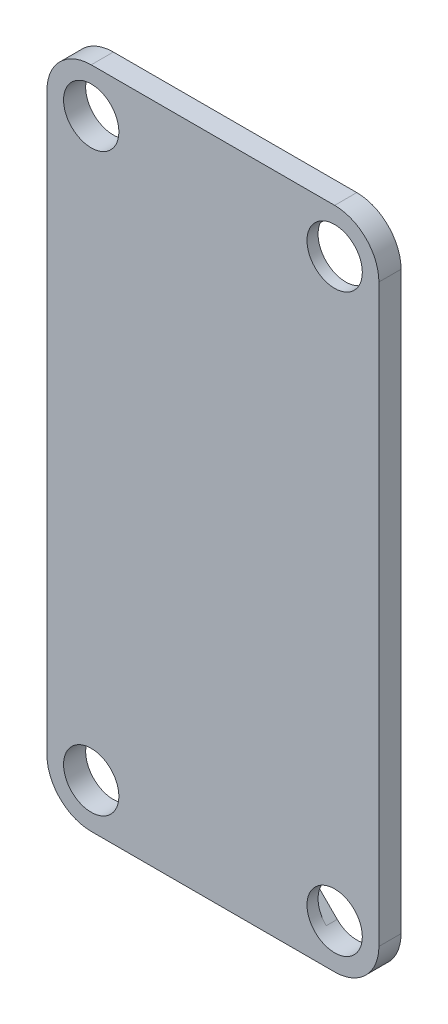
ISO-10303-21;
HEADER;
FILE_DESCRIPTION(('STEP AP214'),'2;1');
FILE_NAME('part.step','',(''),(''),'','','');
FILE_SCHEMA(('AUTOMOTIVE_DESIGN { 1 0 10303 214 1 1 1 1 }'));
ENDSEC;
DATA;
#1=APPLICATION_CONTEXT('core data for automotive mechanical design processes');
#2=APPLICATION_PROTOCOL_DEFINITION('international standard','automotive_design',2000,#1);
#3=PRODUCT_CONTEXT('',#1,'mechanical');
#4=PRODUCT('Part','Part','',(#3));
#5=PRODUCT_RELATED_PRODUCT_CATEGORY('part','',(#4));
#6=PRODUCT_DEFINITION_FORMATION('','',#4);
#7=PRODUCT_DEFINITION_CONTEXT('part definition',#1,'design');
#8=PRODUCT_DEFINITION('design','',#6,#7);
#9=PRODUCT_DEFINITION_SHAPE('','',#8);
#10=(LENGTH_UNIT() NAMED_UNIT(*) SI_UNIT(.MILLI.,.METRE.));
#11=(NAMED_UNIT(*) PLANE_ANGLE_UNIT() SI_UNIT($,.RADIAN.));
#12=(NAMED_UNIT(*) SI_UNIT($,.STERADIAN.) SOLID_ANGLE_UNIT());
#13=UNCERTAINTY_MEASURE_WITH_UNIT(LENGTH_MEASURE(1.E-05),#10,'distance_accuracy_value','');
#14=(GEOMETRIC_REPRESENTATION_CONTEXT(3) GLOBAL_UNCERTAINTY_ASSIGNED_CONTEXT((#13)) GLOBAL_UNIT_ASSIGNED_CONTEXT((#10,
#11,#12)) REPRESENTATION_CONTEXT('',''));
#15=CARTESIAN_POINT('',(0.,0.,0.));
#16=DIRECTION('',(0.,0.,1.));
#17=DIRECTION('',(1.,0.,0.));
#18=AXIS2_PLACEMENT_3D('',#15,#16,#17);
#19=CARTESIAN_POINT('',(-220.,-520.,0.));
#20=DIRECTION('',(0.,0.,1.));
#21=DIRECTION('',(1.,0.,0.));
#22=AXIS2_PLACEMENT_3D('',#19,#20,#21);
#23=PLANE('',#22);
#24=CARTESIAN_POINT('',(-220.,520.,0.));
#25=DIRECTION('',(0.,0.,1.));
#26=DIRECTION('',(1.,0.,0.));
#27=AXIS2_PLACEMENT_3D('',#24,#25,#26);
#28=CIRCLE('',#27,50.);
#29=CARTESIAN_POINT('',(-170.,520.,0.));
#30=VERTEX_POINT('',#29);
#31=EDGE_CURVE('E254',#30,#30,#28,.T.);
#32=ORIENTED_EDGE('',*,*,#31,.T.);
#33=EDGE_LOOP('',(#32));
#34=FACE_BOUND('',#33,.T.);
#35=CARTESIAN_POINT('',(-219.999999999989,-520.,0.));
#36=DIRECTION('',(0.,0.,1.));
#37=DIRECTION('',(1.,0.,0.));
#38=AXIS2_PLACEMENT_3D('',#35,#36,#37);
#39=CIRCLE('',#38,50.);
#40=CARTESIAN_POINT('',(-169.999999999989,-520.,0.));
#41=VERTEX_POINT('',#40);
#42=EDGE_CURVE('E230',#41,#41,#39,.T.);
#43=ORIENTED_EDGE('',*,*,#42,.T.);
#44=EDGE_LOOP('',(#43));
#45=FACE_BOUND('',#44,.T.);
#46=CARTESIAN_POINT('',(-220.,-520.,0.));
#47=DIRECTION('',(0.,0.,1.));
#48=DIRECTION('',(1.,0.,0.));
#49=AXIS2_PLACEMENT_3D('',#46,#47,#48);
#50=CIRCLE('',#49,80.);
#51=CARTESIAN_POINT('',(-300.,-520.,0.));
#52=VERTEX_POINT('',#51);
#53=CARTESIAN_POINT('',(-219.999999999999,-600.,0.));
#54=VERTEX_POINT('',#53);
#55=EDGE_CURVE('E160',#52,#54,#50,.T.);
#56=ORIENTED_EDGE('',*,*,#55,.F.);
#57=DIRECTION('',(0.,-1.,0.));
#58=VECTOR('',#57,1.);
#59=CARTESIAN_POINT('',(-300.,519.999999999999,0.));
#60=LINE('',#59,#58);
#61=CARTESIAN_POINT('',(-300.,519.999999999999,0.));
#62=VERTEX_POINT('',#61);
#63=EDGE_CURVE('E102',#62,#52,#60,.T.);
#64=ORIENTED_EDGE('',*,*,#63,.F.);
#65=CARTESIAN_POINT('',(-220.,520.,0.));
#66=DIRECTION('',(0.,0.,1.));
#67=DIRECTION('',(1.,0.,0.));
#68=AXIS2_PLACEMENT_3D('',#65,#66,#67);
#69=CIRCLE('',#68,80.);
#70=CARTESIAN_POINT('',(-219.999999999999,600.,0.));
#71=VERTEX_POINT('',#70);
#72=EDGE_CURVE('E179',#71,#62,#69,.T.);
#73=ORIENTED_EDGE('',*,*,#72,.F.);
#74=DIRECTION('',(-1.,0.,0.));
#75=VECTOR('',#74,1.);
#76=CARTESIAN_POINT('',(219.999999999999,600.,0.));
#77=LINE('',#76,#75);
#78=CARTESIAN_POINT('',(219.999999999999,600.,0.));
#79=VERTEX_POINT('',#78);
#80=EDGE_CURVE('E144',#79,#71,#77,.T.);
#81=ORIENTED_EDGE('',*,*,#80,.F.);
#82=CARTESIAN_POINT('',(220.,520.,0.));
#83=DIRECTION('',(0.,0.,1.));
#84=DIRECTION('',(1.,0.,0.));
#85=AXIS2_PLACEMENT_3D('',#82,#83,#84);
#86=CIRCLE('',#85,80.);
#87=CARTESIAN_POINT('',(300.,519.999999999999,0.));
#88=VERTEX_POINT('',#87);
#89=EDGE_CURVE('E174',#88,#79,#86,.T.);
#90=ORIENTED_EDGE('',*,*,#89,.F.);
#91=DIRECTION('',(0.,1.,0.));
#92=VECTOR('',#91,1.);
#93=CARTESIAN_POINT('',(300.,-520.,0.));
#94=LINE('',#93,#92);
#95=CARTESIAN_POINT('',(300.,-520.,0.));
#96=VERTEX_POINT('',#95);
#97=EDGE_CURVE('E171',#96,#88,#94,.T.);
#98=ORIENTED_EDGE('',*,*,#97,.F.);
#99=CARTESIAN_POINT('',(220.,-520.,0.));
#100=DIRECTION('',(0.,0.,1.));
#101=DIRECTION('',(1.,0.,0.));
#102=AXIS2_PLACEMENT_3D('',#99,#100,#101);
#103=CIRCLE('',#102,80.);
#104=CARTESIAN_POINT('',(219.999999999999,-600.,0.));
#105=VERTEX_POINT('',#104);
#106=EDGE_CURVE('E168',#105,#96,#103,.T.);
#107=ORIENTED_EDGE('',*,*,#106,.F.);
#108=DIRECTION('',(1.,0.,0.));
#109=VECTOR('',#108,1.);
#110=CARTESIAN_POINT('',(-219.999999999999,-600.,0.));
#111=LINE('',#110,#109);
#112=EDGE_CURVE('E164',#54,#105,#111,.T.);
#113=ORIENTED_EDGE('',*,*,#112,.F.);
#114=EDGE_LOOP('',(#56,#64,#73,#81,#90,#98,#107,#113));
#115=FACE_BOUND('',#114,.T.);
#116=DIRECTION('',(0.,1.,0.));
#117=VECTOR('',#116,1.);
#118=CARTESIAN_POINT('',(270.000000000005,2.82466357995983E-12,0.));
#119=LINE('',#118,#117);
#120=CARTESIAN_POINT('',(270.000000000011,-520.,0.));
#121=VERTEX_POINT('',#120);
#122=CARTESIAN_POINT('',(270.,520.,0.));
#123=VERTEX_POINT('',#122);
#124=EDGE_CURVE('E286',#121,#123,#119,.T.);
#125=ORIENTED_EDGE('',*,*,#124,.T.);
#126=CARTESIAN_POINT('',(220.,520.,0.));
#127=DIRECTION('',(0.,0.,1.));
#128=DIRECTION('',(1.,0.,0.));
#129=AXIS2_PLACEMENT_3D('',#126,#127,#128);
#130=CIRCLE('',#129,50.0000000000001);
#131=CARTESIAN_POINT('',(174.091058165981,539.80830784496,0.));
#132=VERTEX_POINT('',#131);
#133=EDGE_CURVE('E246',#123,#132,#130,.T.);
#134=ORIENTED_EDGE('',*,*,#133,.T.);
#135=DIRECTION('',(0.707106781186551,0.707106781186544,0.));
#136=VECTOR('',#135,1.);
#137=CARTESIAN_POINT('',(-182.85862483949,182.858624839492,0.));
#138=LINE('',#137,#136);
#139=CARTESIAN_POINT('',(-230.,135.717249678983,0.));
#140=VERTEX_POINT('',#139);
#141=EDGE_CURVE('E291',#140,#132,#138,.T.);
#142=ORIENTED_EDGE('',*,*,#141,.F.);
#143=DIRECTION('',(0.,1.,0.));
#144=VECTOR('',#143,1.);
#145=CARTESIAN_POINT('',(-230.,0.,0.));
#146=LINE('',#145,#144);
#147=CARTESIAN_POINT('',(-230.,-140.710678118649,0.));
#148=VERTEX_POINT('',#147);
#149=EDGE_CURVE('E295',#148,#140,#146,.T.);
#150=ORIENTED_EDGE('',*,*,#149,.F.);
#151=DIRECTION('',(-0.707106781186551,0.707106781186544,0.));
#152=VECTOR('',#151,1.);
#153=CARTESIAN_POINT('',(-185.355339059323,-185.355339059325,0.));
#154=LINE('',#153,#152);
#155=CARTESIAN_POINT('',(184.644660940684,-555.355339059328,0.));
#156=VERTEX_POINT('',#155);
#157=EDGE_CURVE('E299',#156,#148,#154,.T.);
#158=ORIENTED_EDGE('',*,*,#157,.F.);
#159=CARTESIAN_POINT('',(220.000000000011,-520.,0.));
#160=DIRECTION('',(0.,0.,1.));
#161=DIRECTION('',(1.,0.,0.));
#162=AXIS2_PLACEMENT_3D('',#159,#160,#161);
#163=CIRCLE('',#162,50.0000000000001);
#164=EDGE_CURVE('E238',#156,#121,#163,.T.);
#165=ORIENTED_EDGE('',*,*,#164,.T.);
#166=EDGE_LOOP('',(#125,#134,#142,#150,#158,#165));
#167=FACE_BOUND('',#166,.T.);
#168=ADVANCED_FACE('F44',(#34,#45,#115,#167),#23,.F.);
#169=CARTESIAN_POINT('',(-220.,-520.,40.));
#170=DIRECTION('',(0.,0.,1.));
#171=DIRECTION('',(1.,0.,0.));
#172=AXIS2_PLACEMENT_3D('',#169,#170,#171);
#173=PLANE('',#172);
#174=CARTESIAN_POINT('',(220.,520.,40.));
#175=DIRECTION('',(0.,0.,1.));
#176=DIRECTION('',(1.,0.,0.));
#177=AXIS2_PLACEMENT_3D('',#174,#175,#176);
#178=CIRCLE('',#177,50.0000000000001);
#179=CARTESIAN_POINT('',(270.,520.,40.));
#180=VERTEX_POINT('',#179);
#181=EDGE_CURVE('E242',#180,#180,#178,.T.);
#182=ORIENTED_EDGE('',*,*,#181,.F.);
#183=EDGE_LOOP('',(#182));
#184=FACE_BOUND('',#183,.T.);
#185=CARTESIAN_POINT('',(-219.999999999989,-520.,40.));
#186=DIRECTION('',(0.,0.,1.));
#187=DIRECTION('',(1.,0.,0.));
#188=AXIS2_PLACEMENT_3D('',#185,#186,#187);
#189=CIRCLE('',#188,50.);
#190=CARTESIAN_POINT('',(-169.999999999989,-520.,40.));
#191=VERTEX_POINT('',#190);
#192=EDGE_CURVE('E165',#191,#191,#189,.T.);
#193=ORIENTED_EDGE('',*,*,#192,.F.);
#194=EDGE_LOOP('',(#193));
#195=FACE_BOUND('',#194,.T.);
#196=CARTESIAN_POINT('',(-220.,-520.,40.));
#197=DIRECTION('',(0.,0.,1.));
#198=DIRECTION('',(1.,0.,0.));
#199=AXIS2_PLACEMENT_3D('',#196,#197,#198);
#200=CIRCLE('',#199,80.);
#201=CARTESIAN_POINT('',(-300.,-520.,40.));
#202=VERTEX_POINT('',#201);
#203=CARTESIAN_POINT('',(-219.999999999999,-600.,40.));
#204=VERTEX_POINT('',#203);
#205=EDGE_CURVE('E184',#202,#204,#200,.T.);
#206=ORIENTED_EDGE('',*,*,#205,.T.);
#207=DIRECTION('',(1.,0.,0.));
#208=VECTOR('',#207,1.);
#209=CARTESIAN_POINT('',(-219.999999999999,-600.,40.));
#210=LINE('',#209,#208);
#211=CARTESIAN_POINT('',(219.999999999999,-600.,40.));
#212=VERTEX_POINT('',#211);
#213=EDGE_CURVE('E110',#204,#212,#210,.T.);
#214=ORIENTED_EDGE('',*,*,#213,.T.);
#215=CARTESIAN_POINT('',(220.,-520.,40.));
#216=DIRECTION('',(0.,0.,1.));
#217=DIRECTION('',(1.,0.,0.));
#218=AXIS2_PLACEMENT_3D('',#215,#216,#217);
#219=CIRCLE('',#218,80.);
#220=CARTESIAN_POINT('',(300.,-520.,40.));
#221=VERTEX_POINT('',#220);
#222=EDGE_CURVE('E206',#212,#221,#219,.T.);
#223=ORIENTED_EDGE('',*,*,#222,.T.);
#224=DIRECTION('',(0.,1.,0.));
#225=VECTOR('',#224,1.);
#226=CARTESIAN_POINT('',(300.,-520.,40.));
#227=LINE('',#226,#225);
#228=CARTESIAN_POINT('',(300.,519.999999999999,40.));
#229=VERTEX_POINT('',#228);
#230=EDGE_CURVE('E219',#221,#229,#227,.T.);
#231=ORIENTED_EDGE('',*,*,#230,.T.);
#232=CARTESIAN_POINT('',(220.,520.,40.));
#233=DIRECTION('',(0.,0.,1.));
#234=DIRECTION('',(1.,0.,0.));
#235=AXIS2_PLACEMENT_3D('',#232,#233,#234);
#236=CIRCLE('',#235,80.);
#237=CARTESIAN_POINT('',(219.999999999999,600.,40.));
#238=VERTEX_POINT('',#237);
#239=EDGE_CURVE('E134',#229,#238,#236,.T.);
#240=ORIENTED_EDGE('',*,*,#239,.T.);
#241=DIRECTION('',(-1.,0.,0.));
#242=VECTOR('',#241,1.);
#243=CARTESIAN_POINT('',(219.999999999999,600.,40.));
#244=LINE('',#243,#242);
#245=CARTESIAN_POINT('',(-219.999999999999,600.,40.));
#246=VERTEX_POINT('',#245);
#247=EDGE_CURVE('E126',#238,#246,#244,.T.);
#248=ORIENTED_EDGE('',*,*,#247,.T.);
#249=CARTESIAN_POINT('',(-220.,520.,40.));
#250=DIRECTION('',(0.,0.,1.));
#251=DIRECTION('',(1.,0.,0.));
#252=AXIS2_PLACEMENT_3D('',#249,#250,#251);
#253=CIRCLE('',#252,80.);
#254=CARTESIAN_POINT('',(-300.,519.999999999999,40.));
#255=VERTEX_POINT('',#254);
#256=EDGE_CURVE('E131',#246,#255,#253,.T.);
#257=ORIENTED_EDGE('',*,*,#256,.T.);
#258=DIRECTION('',(0.,-1.,0.));
#259=VECTOR('',#258,1.);
#260=CARTESIAN_POINT('',(-300.,519.999999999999,40.));
#261=LINE('',#260,#259);
#262=EDGE_CURVE('E69',#255,#202,#261,.T.);
#263=ORIENTED_EDGE('',*,*,#262,.T.);
#264=EDGE_LOOP('',(#206,#214,#223,#231,#240,#248,#257,#263));
#265=FACE_BOUND('',#264,.T.);
#266=CARTESIAN_POINT('',(220.000000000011,-520.,40.));
#267=DIRECTION('',(0.,0.,1.));
#268=DIRECTION('',(1.,0.,0.));
#269=AXIS2_PLACEMENT_3D('',#266,#267,#268);
#270=CIRCLE('',#269,50.0000000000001);
#271=CARTESIAN_POINT('',(270.000000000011,-520.,40.));
#272=VERTEX_POINT('',#271);
#273=EDGE_CURVE('E234',#272,#272,#270,.T.);
#274=ORIENTED_EDGE('',*,*,#273,.F.);
#275=EDGE_LOOP('',(#274));
#276=FACE_BOUND('',#275,.T.);
#277=CARTESIAN_POINT('',(-220.,520.,40.));
#278=DIRECTION('',(0.,0.,1.));
#279=DIRECTION('',(1.,0.,0.));
#280=AXIS2_PLACEMENT_3D('',#277,#278,#279);
#281=CIRCLE('',#280,50.);
#282=CARTESIAN_POINT('',(-170.,520.,40.));
#283=VERTEX_POINT('',#282);
#284=EDGE_CURVE('E250',#283,#283,#281,.T.);
#285=ORIENTED_EDGE('',*,*,#284,.F.);
#286=EDGE_LOOP('',(#285));
#287=FACE_BOUND('',#286,.T.);
#288=ADVANCED_FACE('F128',(#184,#195,#265,#276,#287),#173,.T.);
#289=CARTESIAN_POINT('',(-220.,-520.,40.));
#290=DIRECTION('',(0.,0.,-1.));
#291=DIRECTION('',(-1.,0.,0.));
#292=AXIS2_PLACEMENT_3D('',#289,#290,#291);
#293=CYLINDRICAL_SURFACE('',#292,80.);
#294=ORIENTED_EDGE('',*,*,#55,.T.);
#295=DIRECTION('',(0.,0.,-1.));
#296=VECTOR('',#295,1.);
#297=CARTESIAN_POINT('',(-219.999999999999,-600.,40.));
#298=LINE('',#297,#296);
#299=EDGE_CURVE('E12',#204,#54,#298,.T.);
#300=ORIENTED_EDGE('',*,*,#299,.F.);
#301=ORIENTED_EDGE('',*,*,#205,.F.);
#302=DIRECTION('',(0.,0.,-1.));
#303=VECTOR('',#302,1.);
#304=CARTESIAN_POINT('',(-300.,-520.,40.));
#305=LINE('',#304,#303);
#306=EDGE_CURVE('E156',#202,#52,#305,.T.);
#307=ORIENTED_EDGE('',*,*,#306,.T.);
#308=EDGE_LOOP('',(#294,#300,#301,#307));
#309=FACE_BOUND('',#308,.T.);
#310=ADVANCED_FACE('F46',(#309),#293,.T.);
#311=CARTESIAN_POINT('',(-219.999999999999,-600.,40.));
#312=DIRECTION('',(0.,1.,0.));
#313=DIRECTION('',(0.,0.,1.));
#314=AXIS2_PLACEMENT_3D('',#311,#312,#313);
#315=PLANE('',#314);
#316=ORIENTED_EDGE('',*,*,#112,.T.);
#317=DIRECTION('',(0.,0.,-1.));
#318=VECTOR('',#317,1.);
#319=CARTESIAN_POINT('',(219.999999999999,-600.,40.));
#320=LINE('',#319,#318);
#321=EDGE_CURVE('E53',#212,#105,#320,.T.);
#322=ORIENTED_EDGE('',*,*,#321,.F.);
#323=ORIENTED_EDGE('',*,*,#213,.F.);
#324=ORIENTED_EDGE('',*,*,#299,.T.);
#325=EDGE_LOOP('',(#316,#322,#323,#324));
#326=FACE_BOUND('',#325,.T.);
#327=ADVANCED_FACE('F404',(#326),#315,.F.);
#328=CARTESIAN_POINT('',(220.,-520.,40.));
#329=DIRECTION('',(0.,0.,-1.));
#330=DIRECTION('',(-1.,0.,0.));
#331=AXIS2_PLACEMENT_3D('',#328,#329,#330);
#332=CYLINDRICAL_SURFACE('',#331,80.);
#333=ORIENTED_EDGE('',*,*,#106,.T.);
#334=DIRECTION('',(0.,0.,-1.));
#335=VECTOR('',#334,1.);
#336=CARTESIAN_POINT('',(300.,-520.,40.));
#337=LINE('',#336,#335);
#338=EDGE_CURVE('E195',#221,#96,#337,.T.);
#339=ORIENTED_EDGE('',*,*,#338,.F.);
#340=ORIENTED_EDGE('',*,*,#222,.F.);
#341=ORIENTED_EDGE('',*,*,#321,.T.);
#342=EDGE_LOOP('',(#333,#339,#340,#341));
#343=FACE_BOUND('',#342,.T.);
#344=ADVANCED_FACE('F204',(#343),#332,.T.);
#345=CARTESIAN_POINT('',(300.,-520.,40.));
#346=DIRECTION('',(-1.,0.,0.));
#347=DIRECTION('',(0.,0.,1.));
#348=AXIS2_PLACEMENT_3D('',#345,#346,#347);
#349=PLANE('',#348);
#350=ORIENTED_EDGE('',*,*,#97,.T.);
#351=DIRECTION('',(0.,0.,-1.));
#352=VECTOR('',#351,1.);
#353=CARTESIAN_POINT('',(300.,519.999999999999,40.));
#354=LINE('',#353,#352);
#355=EDGE_CURVE('E191',#229,#88,#354,.T.);
#356=ORIENTED_EDGE('',*,*,#355,.F.);
#357=ORIENTED_EDGE('',*,*,#230,.F.);
#358=ORIENTED_EDGE('',*,*,#338,.T.);
#359=EDGE_LOOP('',(#350,#356,#357,#358));
#360=FACE_BOUND('',#359,.T.);
#361=ADVANCED_FACE('F214',(#360),#349,.F.);
#362=CARTESIAN_POINT('',(220.,520.,40.));
#363=DIRECTION('',(0.,0.,-1.));
#364=DIRECTION('',(-1.,0.,0.));
#365=AXIS2_PLACEMENT_3D('',#362,#363,#364);
#366=CYLINDRICAL_SURFACE('',#365,80.);
#367=ORIENTED_EDGE('',*,*,#89,.T.);
#368=DIRECTION('',(0.,0.,-1.));
#369=VECTOR('',#368,1.);
#370=CARTESIAN_POINT('',(219.999999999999,600.,40.));
#371=LINE('',#370,#369);
#372=EDGE_CURVE('E148',#238,#79,#371,.T.);
#373=ORIENTED_EDGE('',*,*,#372,.F.);
#374=ORIENTED_EDGE('',*,*,#239,.F.);
#375=ORIENTED_EDGE('',*,*,#355,.T.);
#376=EDGE_LOOP('',(#367,#373,#374,#375));
#377=FACE_BOUND('',#376,.T.);
#378=ADVANCED_FACE('F217',(#377),#366,.T.);
#379=CARTESIAN_POINT('',(219.999999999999,600.,40.));
#380=DIRECTION('',(0.,-1.,0.));
#381=DIRECTION('',(0.,0.,-1.));
#382=AXIS2_PLACEMENT_3D('',#379,#380,#381);
#383=PLANE('',#382);
#384=ORIENTED_EDGE('',*,*,#80,.T.);
#385=DIRECTION('',(0.,0.,-1.));
#386=VECTOR('',#385,1.);
#387=CARTESIAN_POINT('',(-219.999999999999,600.,40.));
#388=LINE('',#387,#386);
#389=EDGE_CURVE('E141',#246,#71,#388,.T.);
#390=ORIENTED_EDGE('',*,*,#389,.F.);
#391=ORIENTED_EDGE('',*,*,#247,.F.);
#392=ORIENTED_EDGE('',*,*,#372,.T.);
#393=EDGE_LOOP('',(#384,#390,#391,#392));
#394=FACE_BOUND('',#393,.T.);
#395=ADVANCED_FACE('F142',(#394),#383,.F.);
#396=CARTESIAN_POINT('',(-220.,520.,40.));
#397=DIRECTION('',(0.,0.,-1.));
#398=DIRECTION('',(-1.,0.,0.));
#399=AXIS2_PLACEMENT_3D('',#396,#397,#398);
#400=CYLINDRICAL_SURFACE('',#399,80.);
#401=ORIENTED_EDGE('',*,*,#72,.T.);
#402=DIRECTION('',(0.,0.,-1.));
#403=VECTOR('',#402,1.);
#404=CARTESIAN_POINT('',(-300.,519.999999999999,40.));
#405=LINE('',#404,#403);
#406=EDGE_CURVE('E149',#255,#62,#405,.T.);
#407=ORIENTED_EDGE('',*,*,#406,.F.);
#408=ORIENTED_EDGE('',*,*,#256,.F.);
#409=ORIENTED_EDGE('',*,*,#389,.T.);
#410=EDGE_LOOP('',(#401,#407,#408,#409));
#411=FACE_BOUND('',#410,.T.);
#412=ADVANCED_FACE('F151',(#411),#400,.T.);
#413=CARTESIAN_POINT('',(-300.,519.999999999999,40.));
#414=DIRECTION('',(1.,0.,0.));
#415=DIRECTION('',(0.,0.,-1.));
#416=AXIS2_PLACEMENT_3D('',#413,#414,#415);
#417=PLANE('',#416);
#418=ORIENTED_EDGE('',*,*,#63,.T.);
#419=ORIENTED_EDGE('',*,*,#306,.F.);
#420=ORIENTED_EDGE('',*,*,#262,.F.);
#421=ORIENTED_EDGE('',*,*,#406,.T.);
#422=EDGE_LOOP('',(#418,#419,#420,#421));
#423=FACE_BOUND('',#422,.T.);
#424=ADVANCED_FACE('F383',(#423),#417,.F.);
#425=CARTESIAN_POINT('',(-219.999999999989,-520.,40.));
#426=DIRECTION('',(0.,0.,-1.));
#427=DIRECTION('',(-1.,0.,0.));
#428=AXIS2_PLACEMENT_3D('',#425,#426,#427);
#429=CYLINDRICAL_SURFACE('',#428,50.);
#430=ORIENTED_EDGE('',*,*,#192,.T.);
#431=EDGE_LOOP('',(#430));
#432=FACE_BOUND('',#431,.T.);
#433=ORIENTED_EDGE('',*,*,#42,.F.);
#434=EDGE_LOOP('',(#433));
#435=FACE_BOUND('',#434,.T.);
#436=ADVANCED_FACE('F380',(#432,#435),#429,.F.);
#437=CARTESIAN_POINT('',(220.000000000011,-520.,40.));
#438=DIRECTION('',(0.,0.,-1.));
#439=DIRECTION('',(-1.,0.,0.));
#440=AXIS2_PLACEMENT_3D('',#437,#438,#439);
#441=CYLINDRICAL_SURFACE('',#440,50.0000000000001);
#442=DIRECTION('',(0.,0.,-1.));
#443=VECTOR('',#442,1.);
#444=CARTESIAN_POINT('',(184.644660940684,-555.355339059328,20.));
#445=LINE('',#444,#443);
#446=CARTESIAN_POINT('',(184.644660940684,-555.355339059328,20.));
#447=VERTEX_POINT('',#446);
#448=EDGE_CURVE('E258',#447,#156,#445,.T.);
#449=ORIENTED_EDGE('',*,*,#448,.F.);
#450=CARTESIAN_POINT('',(220.000000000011,-520.,20.));
#451=DIRECTION('',(0.,0.,-1.));
#452=DIRECTION('',(-1.,0.,0.));
#453=AXIS2_PLACEMENT_3D('',#450,#451,#452);
#454=CIRCLE('',#453,50.0000000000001);
#455=CARTESIAN_POINT('',(270.000000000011,-520.,20.));
#456=VERTEX_POINT('',#455);
#457=EDGE_CURVE('E267',#456,#447,#454,.F.);
#458=ORIENTED_EDGE('',*,*,#457,.F.);
#459=DIRECTION('',(0.,0.,-1.));
#460=VECTOR('',#459,1.);
#461=CARTESIAN_POINT('',(270.000000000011,-520.,20.));
#462=LINE('',#461,#460);
#463=EDGE_CURVE('E279',#456,#121,#462,.T.);
#464=ORIENTED_EDGE('',*,*,#463,.T.);
#465=ORIENTED_EDGE('',*,*,#164,.F.);
#466=EDGE_LOOP('',(#449,#458,#464,#465));
#467=FACE_BOUND('',#466,.T.);
#468=ORIENTED_EDGE('',*,*,#273,.T.);
#469=EDGE_LOOP('',(#468));
#470=FACE_BOUND('',#469,.T.);
#471=ADVANCED_FACE('F356',(#467,#470),#441,.F.);
#472=CARTESIAN_POINT('',(220.,520.,40.));
#473=DIRECTION('',(0.,0.,-1.));
#474=DIRECTION('',(-1.,0.,0.));
#475=AXIS2_PLACEMENT_3D('',#472,#473,#474);
#476=CYLINDRICAL_SURFACE('',#475,50.0000000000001);
#477=DIRECTION('',(0.,0.,-1.));
#478=VECTOR('',#477,1.);
#479=CARTESIAN_POINT('',(270.,520.,20.));
#480=LINE('',#479,#478);
#481=CARTESIAN_POINT('',(270.,520.,20.));
#482=VERTEX_POINT('',#481);
#483=EDGE_CURVE('E275',#482,#123,#480,.T.);
#484=ORIENTED_EDGE('',*,*,#483,.F.);
#485=CARTESIAN_POINT('',(220.,520.,20.));
#486=DIRECTION('',(0.,0.,-1.));
#487=DIRECTION('',(-1.,0.,0.));
#488=AXIS2_PLACEMENT_3D('',#485,#486,#487);
#489=CIRCLE('',#488,50.0000000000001);
#490=CARTESIAN_POINT('',(174.091058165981,539.80830784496,20.));
#491=VERTEX_POINT('',#490);
#492=EDGE_CURVE('E310',#491,#482,#489,.F.);
#493=ORIENTED_EDGE('',*,*,#492,.F.);
#494=DIRECTION('',(0.,0.,-1.));
#495=VECTOR('',#494,1.);
#496=CARTESIAN_POINT('',(174.091058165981,539.80830784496,20.));
#497=LINE('',#496,#495);
#498=EDGE_CURVE('E271',#491,#132,#497,.T.);
#499=ORIENTED_EDGE('',*,*,#498,.T.);
#500=ORIENTED_EDGE('',*,*,#133,.F.);
#501=EDGE_LOOP('',(#484,#493,#499,#500));
#502=FACE_BOUND('',#501,.T.);
#503=ORIENTED_EDGE('',*,*,#181,.T.);
#504=EDGE_LOOP('',(#503));
#505=FACE_BOUND('',#504,.T.);
#506=ADVANCED_FACE('F368',(#502,#505),#476,.F.);
#507=CARTESIAN_POINT('',(-220.,520.,40.));
#508=DIRECTION('',(0.,0.,-1.));
#509=DIRECTION('',(-1.,0.,0.));
#510=AXIS2_PLACEMENT_3D('',#507,#508,#509);
#511=CYLINDRICAL_SURFACE('',#510,50.);
#512=ORIENTED_EDGE('',*,*,#284,.T.);
#513=EDGE_LOOP('',(#512));
#514=FACE_BOUND('',#513,.T.);
#515=ORIENTED_EDGE('',*,*,#31,.F.);
#516=EDGE_LOOP('',(#515));
#517=FACE_BOUND('',#516,.T.);
#518=ADVANCED_FACE('F371',(#514,#517),#511,.F.);
#519=CARTESIAN_POINT('',(-185.355339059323,-185.355339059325,20.));
#520=DIRECTION('',(-0.707106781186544,-0.707106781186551,0.));
#521=DIRECTION('',(0.707106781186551,-0.707106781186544,0.));
#522=AXIS2_PLACEMENT_3D('',#519,#520,#521);
#523=PLANE('',#522);
#524=ORIENTED_EDGE('',*,*,#157,.T.);
#525=DIRECTION('',(0.,0.,-1.));
#526=VECTOR('',#525,1.);
#527=CARTESIAN_POINT('',(-230.,-140.710678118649,20.));
#528=LINE('',#527,#526);
#529=CARTESIAN_POINT('',(-230.,-140.710678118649,20.));
#530=VERTEX_POINT('',#529);
#531=EDGE_CURVE('E262',#530,#148,#528,.T.);
#532=ORIENTED_EDGE('',*,*,#531,.F.);
#533=DIRECTION('',(-0.707106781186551,0.707106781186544,0.));
#534=VECTOR('',#533,1.);
#535=CARTESIAN_POINT('',(-185.355339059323,-185.355339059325,20.));
#536=LINE('',#535,#534);
#537=EDGE_CURVE('E290',#447,#530,#536,.T.);
#538=ORIENTED_EDGE('',*,*,#537,.F.);
#539=ORIENTED_EDGE('',*,*,#448,.T.);
#540=EDGE_LOOP('',(#524,#532,#538,#539));
#541=FACE_BOUND('',#540,.T.);
#542=ADVANCED_FACE('F332',(#541),#523,.F.);
#543=CARTESIAN_POINT('',(270.000000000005,2.82466357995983E-12,20.));
#544=DIRECTION('',(-1.,0.,0.));
#545=DIRECTION('',(0.,-1.,0.));
#546=AXIS2_PLACEMENT_3D('',#543,#544,#545);
#547=PLANE('',#546);
#548=ORIENTED_EDGE('',*,*,#124,.F.);
#549=ORIENTED_EDGE('',*,*,#463,.F.);
#550=DIRECTION('',(0.,1.,0.));
#551=VECTOR('',#550,1.);
#552=CARTESIAN_POINT('',(270.000000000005,2.82466357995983E-12,20.));
#553=LINE('',#552,#551);
#554=EDGE_CURVE('E306',#456,#482,#553,.T.);
#555=ORIENTED_EDGE('',*,*,#554,.T.);
#556=ORIENTED_EDGE('',*,*,#483,.T.);
#557=EDGE_LOOP('',(#548,#549,#555,#556));
#558=FACE_BOUND('',#557,.T.);
#559=ADVANCED_FACE('F351',(#558),#547,.T.);
#560=CARTESIAN_POINT('',(-182.85862483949,182.858624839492,20.));
#561=DIRECTION('',(-0.707106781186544,0.707106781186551,0.));
#562=DIRECTION('',(-0.707106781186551,-0.707106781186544,0.));
#563=AXIS2_PLACEMENT_3D('',#560,#561,#562);
#564=PLANE('',#563);
#565=ORIENTED_EDGE('',*,*,#141,.T.);
#566=ORIENTED_EDGE('',*,*,#498,.F.);
#567=DIRECTION('',(0.707106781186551,0.707106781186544,0.));
#568=VECTOR('',#567,1.);
#569=CARTESIAN_POINT('',(-182.85862483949,182.858624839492,20.));
#570=LINE('',#569,#568);
#571=CARTESIAN_POINT('',(-230.,135.717249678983,20.));
#572=VERTEX_POINT('',#571);
#573=EDGE_CURVE('E60',#572,#491,#570,.T.);
#574=ORIENTED_EDGE('',*,*,#573,.F.);
#575=DIRECTION('',(0.,0.,-1.));
#576=VECTOR('',#575,1.);
#577=CARTESIAN_POINT('',(-230.,135.717249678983,20.));
#578=LINE('',#577,#576);
#579=EDGE_CURVE('E266',#572,#140,#578,.T.);
#580=ORIENTED_EDGE('',*,*,#579,.T.);
#581=EDGE_LOOP('',(#565,#566,#574,#580));
#582=FACE_BOUND('',#581,.T.);
#583=ADVANCED_FACE('F365',(#582),#564,.F.);
#584=CARTESIAN_POINT('',(-230.,0.,20.));
#585=DIRECTION('',(-1.,0.,0.));
#586=DIRECTION('',(0.,-1.,0.));
#587=AXIS2_PLACEMENT_3D('',#584,#585,#586);
#588=PLANE('',#587);
#589=ORIENTED_EDGE('',*,*,#149,.T.);
#590=ORIENTED_EDGE('',*,*,#579,.F.);
#591=DIRECTION('',(0.,1.,0.));
#592=VECTOR('',#591,1.);
#593=CARTESIAN_POINT('',(-230.,0.,20.));
#594=LINE('',#593,#592);
#595=EDGE_CURVE('E315',#530,#572,#594,.T.);
#596=ORIENTED_EDGE('',*,*,#595,.F.);
#597=ORIENTED_EDGE('',*,*,#531,.T.);
#598=EDGE_LOOP('',(#589,#590,#596,#597));
#599=FACE_BOUND('',#598,.T.);
#600=ADVANCED_FACE('F362',(#599),#588,.F.);
#601=CARTESIAN_POINT('',(0.,0.,20.));
#602=DIRECTION('',(0.,0.,-1.));
#603=DIRECTION('',(-1.,0.,0.));
#604=AXIS2_PLACEMENT_3D('',#601,#602,#603);
#605=PLANE('',#604);
#606=ORIENTED_EDGE('',*,*,#537,.T.);
#607=ORIENTED_EDGE('',*,*,#595,.T.);
#608=ORIENTED_EDGE('',*,*,#573,.T.);
#609=ORIENTED_EDGE('',*,*,#492,.T.);
#610=ORIENTED_EDGE('',*,*,#554,.F.);
#611=ORIENTED_EDGE('',*,*,#457,.T.);
#612=EDGE_LOOP('',(#606,#607,#608,#609,#610,#611));
#613=FACE_BOUND('',#612,.T.);
#614=ADVANCED_FACE('F323',(#613),#605,.T.);
#615=CLOSED_SHELL('',(#168,#288,#310,#327,#344,#361,#378,#395,#412,#424,#436,#471,#506,#518,
#542,#559,#583,#600,#614));
#616=MANIFOLD_SOLID_BREP('B2',#615);
#617=ADVANCED_BREP_SHAPE_REPRESENTATION('',(#18,#616),#14);
#618=SHAPE_DEFINITION_REPRESENTATION(#9,#617);
ENDSEC;
END-ISO-10303-21;
